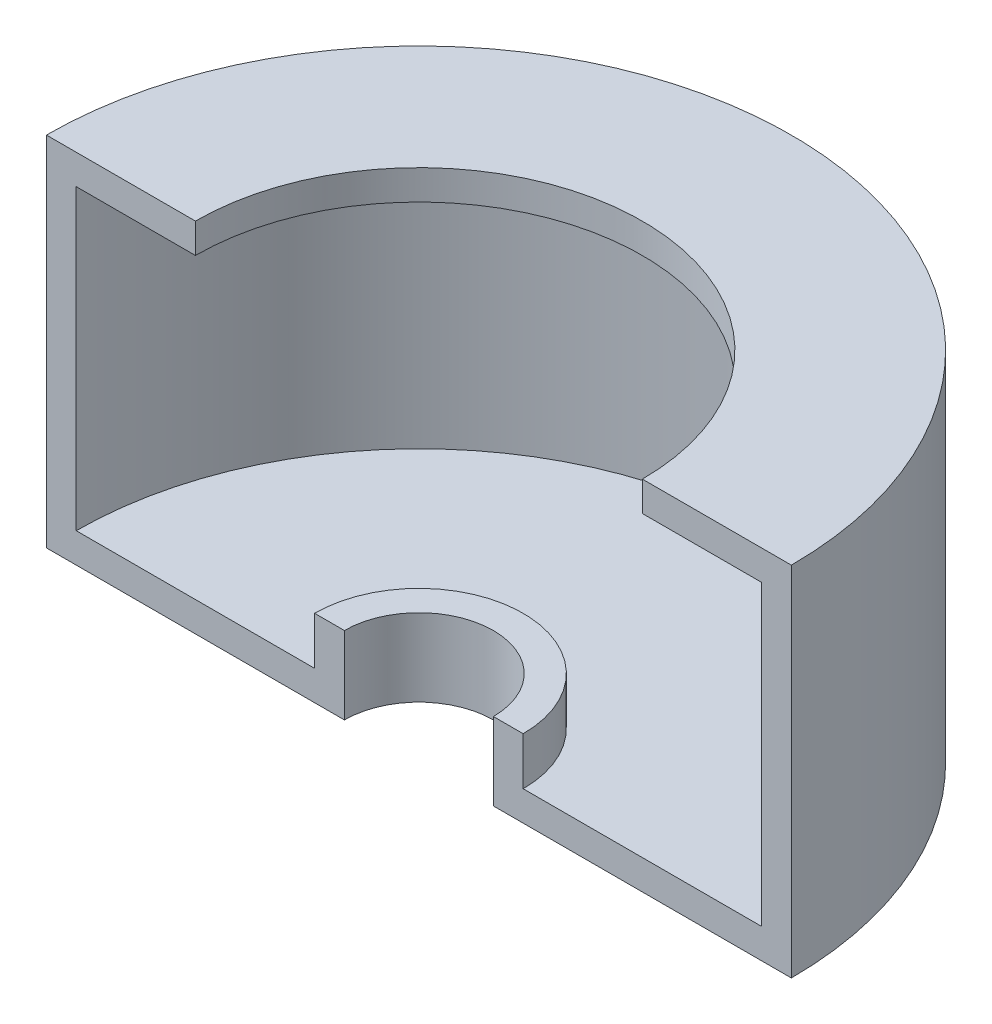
ISO-10303-21;
HEADER;
FILE_DESCRIPTION(('STEP AP214'),'2;1');
FILE_NAME('part.step','',(''),(''),'','','');
FILE_SCHEMA(('AUTOMOTIVE_DESIGN { 1 0 10303 214 1 1 1 1 }'));
ENDSEC;
DATA;
#1=APPLICATION_CONTEXT('core data for automotive mechanical design processes');
#2=APPLICATION_PROTOCOL_DEFINITION('international standard','automotive_design',2000,#1);
#3=PRODUCT_CONTEXT('',#1,'mechanical');
#4=PRODUCT('Part','Part','',(#3));
#5=PRODUCT_RELATED_PRODUCT_CATEGORY('part','',(#4));
#6=PRODUCT_DEFINITION_FORMATION('','',#4);
#7=PRODUCT_DEFINITION_CONTEXT('part definition',#1,'design');
#8=PRODUCT_DEFINITION('design','',#6,#7);
#9=PRODUCT_DEFINITION_SHAPE('','',#8);
#10=(LENGTH_UNIT() NAMED_UNIT(*) SI_UNIT(.MILLI.,.METRE.));
#11=(NAMED_UNIT(*) PLANE_ANGLE_UNIT() SI_UNIT($,.RADIAN.));
#12=(NAMED_UNIT(*) SI_UNIT($,.STERADIAN.) SOLID_ANGLE_UNIT());
#13=UNCERTAINTY_MEASURE_WITH_UNIT(LENGTH_MEASURE(1.E-05),#10,'distance_accuracy_value','');
#14=(GEOMETRIC_REPRESENTATION_CONTEXT(3) GLOBAL_UNCERTAINTY_ASSIGNED_CONTEXT((#13)) GLOBAL_UNIT_ASSIGNED_CONTEXT((#10,
#11,#12)) REPRESENTATION_CONTEXT('',''));
#15=CARTESIAN_POINT('',(0.,0.,0.));
#16=DIRECTION('',(0.,0.,1.));
#17=DIRECTION('',(1.,0.,0.));
#18=AXIS2_PLACEMENT_3D('',#15,#16,#17);
#19=CARTESIAN_POINT('',(-37.4999999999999,55.,2.61861100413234E-13));
#20=DIRECTION('',(0.,1.,0.));
#21=DIRECTION('',(0.,0.,1.));
#22=AXIS2_PLACEMENT_3D('',#19,#20,#21);
#23=PLANE('',#22);
#24=CARTESIAN_POINT('',(0.,55.,0.));
#25=DIRECTION('',(0.,-1.,0.));
#26=DIRECTION('',(0.,0.,-1.));
#27=AXIS2_PLACEMENT_3D('',#24,#25,#26);
#28=CIRCLE('',#27,37.4999999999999);
#29=CARTESIAN_POINT('',(-37.4999999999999,55.,2.61861100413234E-13));
#30=VERTEX_POINT('',#29);
#31=CARTESIAN_POINT('',(37.4999999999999,55.,0.));
#32=VERTEX_POINT('',#31);
#33=EDGE_CURVE('E11',#30,#32,#28,.T.);
#34=ORIENTED_EDGE('',*,*,#33,.T.);
#35=DIRECTION('',(1.,0.,0.));
#36=VECTOR('',#35,1.);
#37=CARTESIAN_POINT('',(37.4999999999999,55.,0.));
#38=LINE('',#37,#36);
#39=CARTESIAN_POINT('',(62.4999999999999,55.,0.));
#40=VERTEX_POINT('',#39);
#41=EDGE_CURVE('E109',#40,#32,#38,.F.);
#42=ORIENTED_EDGE('',*,*,#41,.F.);
#43=CARTESIAN_POINT('',(0.,55.,0.));
#44=DIRECTION('',(0.,-1.,0.));
#45=DIRECTION('',(0.,0.,-1.));
#46=AXIS2_PLACEMENT_3D('',#43,#44,#45);
#47=CIRCLE('',#46,62.4999999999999);
#48=CARTESIAN_POINT('',(-62.4999999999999,55.,4.36435167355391E-13));
#49=VERTEX_POINT('',#48);
#50=EDGE_CURVE('E48',#49,#40,#47,.T.);
#51=ORIENTED_EDGE('',*,*,#50,.F.);
#52=DIRECTION('',(-1.,0.,0.));
#53=VECTOR('',#52,1.);
#54=CARTESIAN_POINT('',(-37.4999999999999,55.,2.61861100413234E-13));
#55=LINE('',#54,#53);
#56=EDGE_CURVE('E111',#49,#30,#55,.F.);
#57=ORIENTED_EDGE('',*,*,#56,.T.);
#58=EDGE_LOOP('',(#34,#42,#51,#57));
#59=FACE_BOUND('',#58,.T.);
#60=ADVANCED_FACE('F33',(#59),#23,.T.);
#61=CARTESIAN_POINT('',(0.,53.4503523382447,0.));
#62=DIRECTION('',(0.,-1.,0.));
#63=DIRECTION('',(0.,0.,-1.));
#64=AXIS2_PLACEMENT_3D('',#61,#62,#63);
#65=CYLINDRICAL_SURFACE('',#64,37.4999999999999);
#66=CARTESIAN_POINT('',(0.,50.,0.));
#67=DIRECTION('',(0.,-1.,0.));
#68=DIRECTION('',(0.,0.,-1.));
#69=AXIS2_PLACEMENT_3D('',#66,#67,#68);
#70=CIRCLE('',#69,37.4999999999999);
#71=CARTESIAN_POINT('',(-37.4999999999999,50.,2.61861100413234E-13));
#72=VERTEX_POINT('',#71);
#73=CARTESIAN_POINT('',(37.4999999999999,50.,0.));
#74=VERTEX_POINT('',#73);
#75=EDGE_CURVE('E41',#72,#74,#70,.T.);
#76=ORIENTED_EDGE('',*,*,#75,.T.);
#77=DIRECTION('',(0.,1.,0.));
#78=VECTOR('',#77,1.);
#79=CARTESIAN_POINT('',(37.4999999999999,50.,0.));
#80=LINE('',#79,#78);
#81=EDGE_CURVE('E120',#74,#32,#80,.T.);
#82=ORIENTED_EDGE('',*,*,#81,.T.);
#83=ORIENTED_EDGE('',*,*,#33,.F.);
#84=DIRECTION('',(0.,1.,0.));
#85=VECTOR('',#84,1.);
#86=CARTESIAN_POINT('',(-37.4999999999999,50.,2.61861100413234E-13));
#87=LINE('',#86,#85);
#88=EDGE_CURVE('E148',#72,#30,#87,.T.);
#89=ORIENTED_EDGE('',*,*,#88,.F.);
#90=EDGE_LOOP('',(#76,#82,#83,#89));
#91=FACE_BOUND('',#90,.T.);
#92=ADVANCED_FACE('F35',(#91),#65,.F.);
#93=CARTESIAN_POINT('',(-37.4999999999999,50.,2.61861100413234E-13));
#94=DIRECTION('',(0.,1.,0.));
#95=DIRECTION('',(0.,0.,1.));
#96=AXIS2_PLACEMENT_3D('',#93,#94,#95);
#97=PLANE('',#96);
#98=CARTESIAN_POINT('',(0.,50.,0.));
#99=DIRECTION('',(0.,-1.,0.));
#100=DIRECTION('',(0.,0.,-1.));
#101=AXIS2_PLACEMENT_3D('',#98,#99,#100);
#102=CIRCLE('',#101,57.4999999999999);
#103=CARTESIAN_POINT('',(-57.4999999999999,50.,4.0152035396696E-13));
#104=VERTEX_POINT('',#103);
#105=CARTESIAN_POINT('',(57.4999999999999,50.,0.));
#106=VERTEX_POINT('',#105);
#107=EDGE_CURVE('E184',#104,#106,#102,.T.);
#108=ORIENTED_EDGE('',*,*,#107,.T.);
#109=DIRECTION('',(-1.,0.,0.));
#110=VECTOR('',#109,1.);
#111=CARTESIAN_POINT('',(37.4999999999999,50.,0.));
#112=LINE('',#111,#110);
#113=EDGE_CURVE('E125',#106,#74,#112,.T.);
#114=ORIENTED_EDGE('',*,*,#113,.T.);
#115=ORIENTED_EDGE('',*,*,#75,.F.);
#116=DIRECTION('',(1.,0.,0.));
#117=VECTOR('',#116,1.);
#118=CARTESIAN_POINT('',(-37.4999999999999,50.,2.61861100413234E-13));
#119=LINE('',#118,#117);
#120=EDGE_CURVE('E150',#104,#72,#119,.T.);
#121=ORIENTED_EDGE('',*,*,#120,.F.);
#122=EDGE_LOOP('',(#108,#114,#115,#121));
#123=FACE_BOUND('',#122,.T.);
#124=ADVANCED_FACE('F187',(#123),#97,.F.);
#125=CARTESIAN_POINT('',(0.,53.4503523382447,0.));
#126=DIRECTION('',(0.,-1.,0.));
#127=DIRECTION('',(0.,0.,-1.));
#128=AXIS2_PLACEMENT_3D('',#125,#126,#127);
#129=CYLINDRICAL_SURFACE('',#128,57.4999999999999);
#130=CARTESIAN_POINT('',(0.,0.,0.));
#131=DIRECTION('',(0.,-1.,0.));
#132=DIRECTION('',(0.,0.,-1.));
#133=AXIS2_PLACEMENT_3D('',#130,#131,#132);
#134=CIRCLE('',#133,57.4999999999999);
#135=CARTESIAN_POINT('',(-57.4999999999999,0.,4.0152035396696E-13));
#136=VERTEX_POINT('',#135);
#137=CARTESIAN_POINT('',(57.4999999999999,0.,0.));
#138=VERTEX_POINT('',#137);
#139=EDGE_CURVE('E182',#136,#138,#134,.T.);
#140=ORIENTED_EDGE('',*,*,#139,.T.);
#141=DIRECTION('',(0.,1.,0.));
#142=VECTOR('',#141,1.);
#143=CARTESIAN_POINT('',(57.4999999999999,50.,0.));
#144=LINE('',#143,#142);
#145=EDGE_CURVE('E127',#138,#106,#144,.T.);
#146=ORIENTED_EDGE('',*,*,#145,.T.);
#147=ORIENTED_EDGE('',*,*,#107,.F.);
#148=DIRECTION('',(0.,1.,0.));
#149=VECTOR('',#148,1.);
#150=CARTESIAN_POINT('',(-57.4999999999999,50.,4.0152035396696E-13));
#151=LINE('',#150,#149);
#152=EDGE_CURVE('E153',#136,#104,#151,.T.);
#153=ORIENTED_EDGE('',*,*,#152,.F.);
#154=EDGE_LOOP('',(#140,#146,#147,#153));
#155=FACE_BOUND('',#154,.T.);
#156=ADVANCED_FACE('F192',(#155),#129,.F.);
#157=CARTESIAN_POINT('',(-17.5,0.,1.2220184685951E-13));
#158=DIRECTION('',(0.,-1.,0.));
#159=DIRECTION('',(0.,0.,-1.));
#160=AXIS2_PLACEMENT_3D('',#157,#158,#159);
#161=PLANE('',#160);
#162=CARTESIAN_POINT('',(0.,0.,0.));
#163=DIRECTION('',(0.,-1.,0.));
#164=DIRECTION('',(0.,0.,-1.));
#165=AXIS2_PLACEMENT_3D('',#162,#163,#164);
#166=CIRCLE('',#165,17.5);
#167=CARTESIAN_POINT('',(-17.5,0.,1.2220184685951E-13));
#168=VERTEX_POINT('',#167);
#169=CARTESIAN_POINT('',(17.5,0.,0.));
#170=VERTEX_POINT('',#169);
#171=EDGE_CURVE('E180',#168,#170,#166,.T.);
#172=ORIENTED_EDGE('',*,*,#171,.T.);
#173=DIRECTION('',(1.,0.,0.));
#174=VECTOR('',#173,1.);
#175=CARTESIAN_POINT('',(17.5,0.,0.));
#176=LINE('',#175,#174);
#177=EDGE_CURVE('E132',#170,#138,#176,.T.);
#178=ORIENTED_EDGE('',*,*,#177,.T.);
#179=ORIENTED_EDGE('',*,*,#139,.F.);
#180=DIRECTION('',(-1.,0.,0.));
#181=VECTOR('',#180,1.);
#182=CARTESIAN_POINT('',(-17.5,0.,1.2220184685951E-13));
#183=LINE('',#182,#181);
#184=EDGE_CURVE('E156',#168,#136,#183,.T.);
#185=ORIENTED_EDGE('',*,*,#184,.F.);
#186=EDGE_LOOP('',(#172,#178,#179,#185));
#187=FACE_BOUND('',#186,.T.);
#188=ADVANCED_FACE('F195',(#187),#161,.F.);
#189=CARTESIAN_POINT('',(0.,53.4503523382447,0.));
#190=DIRECTION('',(0.,-1.,0.));
#191=DIRECTION('',(0.,0.,-1.));
#192=AXIS2_PLACEMENT_3D('',#189,#190,#191);
#193=CYLINDRICAL_SURFACE('',#192,17.5);
#194=CARTESIAN_POINT('',(0.,8.,0.));
#195=DIRECTION('',(0.,-1.,0.));
#196=DIRECTION('',(0.,0.,-1.));
#197=AXIS2_PLACEMENT_3D('',#194,#195,#196);
#198=CIRCLE('',#197,17.5);
#199=CARTESIAN_POINT('',(-17.5,8.,1.2220184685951E-13));
#200=VERTEX_POINT('',#199);
#201=CARTESIAN_POINT('',(17.5,8.,0.));
#202=VERTEX_POINT('',#201);
#203=EDGE_CURVE('E178',#200,#202,#198,.T.);
#204=ORIENTED_EDGE('',*,*,#203,.T.);
#205=DIRECTION('',(0.,-1.,0.));
#206=VECTOR('',#205,1.);
#207=CARTESIAN_POINT('',(17.5,0.,0.));
#208=LINE('',#207,#206);
#209=EDGE_CURVE('E135',#202,#170,#208,.T.);
#210=ORIENTED_EDGE('',*,*,#209,.T.);
#211=ORIENTED_EDGE('',*,*,#171,.F.);
#212=DIRECTION('',(0.,-1.,0.));
#213=VECTOR('',#212,1.);
#214=CARTESIAN_POINT('',(-17.5,0.,1.2220184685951E-13));
#215=LINE('',#214,#213);
#216=EDGE_CURVE('E159',#200,#168,#215,.T.);
#217=ORIENTED_EDGE('',*,*,#216,.F.);
#218=EDGE_LOOP('',(#204,#210,#211,#217));
#219=FACE_BOUND('',#218,.T.);
#220=ADVANCED_FACE('F199',(#219),#193,.T.);
#221=CARTESIAN_POINT('',(-12.5,8.,0.));
#222=DIRECTION('',(0.,-1.,0.));
#223=DIRECTION('',(0.,0.,-1.));
#224=AXIS2_PLACEMENT_3D('',#221,#222,#223);
#225=PLANE('',#224);
#226=CARTESIAN_POINT('',(0.,8.,0.));
#227=DIRECTION('',(0.,-1.,0.));
#228=DIRECTION('',(0.,0.,-1.));
#229=AXIS2_PLACEMENT_3D('',#226,#227,#228);
#230=CIRCLE('',#229,12.5);
#231=CARTESIAN_POINT('',(-12.5,8.,0.));
#232=VERTEX_POINT('',#231);
#233=CARTESIAN_POINT('',(12.5,8.,0.));
#234=VERTEX_POINT('',#233);
#235=EDGE_CURVE('E176',#232,#234,#230,.T.);
#236=ORIENTED_EDGE('',*,*,#235,.T.);
#237=DIRECTION('',(1.,0.,0.));
#238=VECTOR('',#237,1.);
#239=CARTESIAN_POINT('',(12.5,8.,0.));
#240=LINE('',#239,#238);
#241=EDGE_CURVE('E138',#234,#202,#240,.T.);
#242=ORIENTED_EDGE('',*,*,#241,.T.);
#243=ORIENTED_EDGE('',*,*,#203,.F.);
#244=DIRECTION('',(-1.,0.,0.));
#245=VECTOR('',#244,1.);
#246=CARTESIAN_POINT('',(-12.5,8.,0.));
#247=LINE('',#246,#245);
#248=EDGE_CURVE('E162',#232,#200,#247,.T.);
#249=ORIENTED_EDGE('',*,*,#248,.F.);
#250=EDGE_LOOP('',(#236,#242,#243,#249));
#251=FACE_BOUND('',#250,.T.);
#252=ADVANCED_FACE('F203',(#251),#225,.F.);
#253=CARTESIAN_POINT('',(0.,53.4503523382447,0.));
#254=DIRECTION('',(0.,-1.,0.));
#255=DIRECTION('',(0.,0.,-1.));
#256=AXIS2_PLACEMENT_3D('',#253,#254,#255);
#257=CYLINDRICAL_SURFACE('',#256,12.5);
#258=CARTESIAN_POINT('',(0.,-5.,0.));
#259=DIRECTION('',(0.,-1.,0.));
#260=DIRECTION('',(0.,0.,-1.));
#261=AXIS2_PLACEMENT_3D('',#258,#259,#260);
#262=CIRCLE('',#261,12.5);
#263=CARTESIAN_POINT('',(-12.5,-5.,0.));
#264=VERTEX_POINT('',#263);
#265=CARTESIAN_POINT('',(12.5,-5.,0.));
#266=VERTEX_POINT('',#265);
#267=EDGE_CURVE('E174',#264,#266,#262,.T.);
#268=ORIENTED_EDGE('',*,*,#267,.T.);
#269=DIRECTION('',(0.,1.,0.));
#270=VECTOR('',#269,1.);
#271=CARTESIAN_POINT('',(12.5,0.,0.));
#272=LINE('',#271,#270);
#273=EDGE_CURVE('E141',#234,#266,#272,.F.);
#274=ORIENTED_EDGE('',*,*,#273,.F.);
#275=ORIENTED_EDGE('',*,*,#235,.F.);
#276=DIRECTION('',(0.,1.,0.));
#277=VECTOR('',#276,1.);
#278=CARTESIAN_POINT('',(-12.5,0.,0.));
#279=LINE('',#278,#277);
#280=EDGE_CURVE('E165',#232,#264,#279,.F.);
#281=ORIENTED_EDGE('',*,*,#280,.T.);
#282=EDGE_LOOP('',(#268,#274,#275,#281));
#283=FACE_BOUND('',#282,.T.);
#284=ADVANCED_FACE('F208',(#283),#257,.F.);
#285=CARTESIAN_POINT('',(-17.5,-5.,1.2220184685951E-13));
#286=DIRECTION('',(0.,-1.,0.));
#287=DIRECTION('',(0.,0.,-1.));
#288=AXIS2_PLACEMENT_3D('',#285,#286,#287);
#289=PLANE('',#288);
#290=CARTESIAN_POINT('',(0.,-5.,0.));
#291=DIRECTION('',(0.,-1.,0.));
#292=DIRECTION('',(0.,0.,-1.));
#293=AXIS2_PLACEMENT_3D('',#290,#291,#292);
#294=CIRCLE('',#293,62.4999999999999);
#295=CARTESIAN_POINT('',(-62.4999999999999,-5.,4.36435167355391E-13));
#296=VERTEX_POINT('',#295);
#297=CARTESIAN_POINT('',(62.4999999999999,-5.,0.));
#298=VERTEX_POINT('',#297);
#299=EDGE_CURVE('E56',#296,#298,#294,.T.);
#300=ORIENTED_EDGE('',*,*,#299,.T.);
#301=DIRECTION('',(1.,0.,0.));
#302=VECTOR('',#301,1.);
#303=CARTESIAN_POINT('',(17.5,-5.,0.));
#304=LINE('',#303,#302);
#305=EDGE_CURVE('E144',#266,#298,#304,.T.);
#306=ORIENTED_EDGE('',*,*,#305,.F.);
#307=ORIENTED_EDGE('',*,*,#267,.F.);
#308=DIRECTION('',(-1.,0.,0.));
#309=VECTOR('',#308,1.);
#310=CARTESIAN_POINT('',(-17.5,-5.,1.2220184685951E-13));
#311=LINE('',#310,#309);
#312=EDGE_CURVE('E168',#264,#296,#311,.T.);
#313=ORIENTED_EDGE('',*,*,#312,.T.);
#314=EDGE_LOOP('',(#300,#306,#307,#313));
#315=FACE_BOUND('',#314,.T.);
#316=ADVANCED_FACE('F211',(#315),#289,.T.);
#317=CARTESIAN_POINT('',(0.,53.4503523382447,0.));
#318=DIRECTION('',(0.,-1.,0.));
#319=DIRECTION('',(0.,0.,-1.));
#320=AXIS2_PLACEMENT_3D('',#317,#318,#319);
#321=CYLINDRICAL_SURFACE('',#320,62.4999999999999);
#322=DIRECTION('',(0.,1.,0.));
#323=VECTOR('',#322,1.);
#324=CARTESIAN_POINT('',(-62.4999999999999,50.,4.36435167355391E-13));
#325=LINE('',#324,#323);
#326=EDGE_CURVE('E170',#296,#49,#325,.T.);
#327=ORIENTED_EDGE('',*,*,#326,.T.);
#328=ORIENTED_EDGE('',*,*,#50,.T.);
#329=DIRECTION('',(0.,1.,0.));
#330=VECTOR('',#329,1.);
#331=CARTESIAN_POINT('',(62.4999999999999,50.,0.));
#332=LINE('',#331,#330);
#333=EDGE_CURVE('E123',#298,#40,#332,.T.);
#334=ORIENTED_EDGE('',*,*,#333,.F.);
#335=ORIENTED_EDGE('',*,*,#299,.F.);
#336=EDGE_LOOP('',(#327,#328,#334,#335));
#337=FACE_BOUND('',#336,.T.);
#338=ADVANCED_FACE('F213',(#337),#321,.T.);
#339=CARTESIAN_POINT('',(0.,0.,0.));
#340=DIRECTION('',(0.,0.,-1.));
#341=DIRECTION('',(-1.,0.,0.));
#342=AXIS2_PLACEMENT_3D('',#339,#340,#341);
#343=PLANE('',#342);
#344=ORIENTED_EDGE('',*,*,#56,.F.);
#345=ORIENTED_EDGE('',*,*,#326,.F.);
#346=ORIENTED_EDGE('',*,*,#312,.F.);
#347=ORIENTED_EDGE('',*,*,#280,.F.);
#348=ORIENTED_EDGE('',*,*,#248,.T.);
#349=ORIENTED_EDGE('',*,*,#216,.T.);
#350=ORIENTED_EDGE('',*,*,#184,.T.);
#351=ORIENTED_EDGE('',*,*,#152,.T.);
#352=ORIENTED_EDGE('',*,*,#120,.T.);
#353=ORIENTED_EDGE('',*,*,#88,.T.);
#354=EDGE_LOOP('',(#344,#345,#346,#347,#348,#349,#350,#351,#352,#353));
#355=FACE_BOUND('',#354,.T.);
#356=ADVANCED_FACE('F215',(#355),#343,.F.);
#357=CARTESIAN_POINT('',(0.,0.,0.));
#358=DIRECTION('',(0.,0.,1.));
#359=DIRECTION('',(1.,0.,0.));
#360=AXIS2_PLACEMENT_3D('',#357,#358,#359);
#361=PLANE('',#360);
#362=ORIENTED_EDGE('',*,*,#41,.T.);
#363=ORIENTED_EDGE('',*,*,#81,.F.);
#364=ORIENTED_EDGE('',*,*,#113,.F.);
#365=ORIENTED_EDGE('',*,*,#145,.F.);
#366=ORIENTED_EDGE('',*,*,#177,.F.);
#367=ORIENTED_EDGE('',*,*,#209,.F.);
#368=ORIENTED_EDGE('',*,*,#241,.F.);
#369=ORIENTED_EDGE('',*,*,#273,.T.);
#370=ORIENTED_EDGE('',*,*,#305,.T.);
#371=ORIENTED_EDGE('',*,*,#333,.T.);
#372=EDGE_LOOP('',(#362,#363,#364,#365,#366,#367,#368,#369,#370,#371));
#373=FACE_BOUND('',#372,.T.);
#374=ADVANCED_FACE('F118',(#373),#361,.T.);
#375=CLOSED_SHELL('',(#60,#92,#124,#156,#188,#220,#252,#284,#316,#338,#356,#374));
#376=MANIFOLD_SOLID_BREP('B2',#375);
#377=ADVANCED_BREP_SHAPE_REPRESENTATION('',(#18,#376),#14);
#378=SHAPE_DEFINITION_REPRESENTATION(#9,#377);
ENDSEC;
END-ISO-10303-21;
